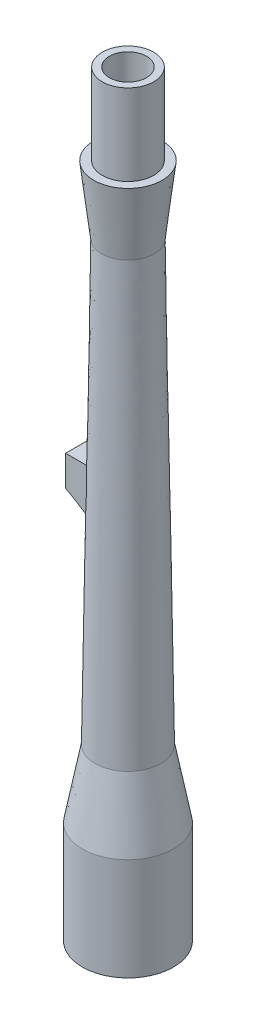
ISO-10303-21;
HEADER;
FILE_DESCRIPTION(('STEP AP214'),'2;1');
FILE_NAME('part.step','',(''),(''),'','','');
FILE_SCHEMA(('AUTOMOTIVE_DESIGN { 1 0 10303 214 1 1 1 1 }'));
ENDSEC;
DATA;
#1=APPLICATION_CONTEXT('core data for automotive mechanical design processes');
#2=APPLICATION_PROTOCOL_DEFINITION('international standard','automotive_design',2000,#1);
#3=PRODUCT_CONTEXT('',#1,'mechanical');
#4=PRODUCT('Part','Part','',(#3));
#5=PRODUCT_RELATED_PRODUCT_CATEGORY('part','',(#4));
#6=PRODUCT_DEFINITION_FORMATION('','',#4);
#7=PRODUCT_DEFINITION_CONTEXT('part definition',#1,'design');
#8=PRODUCT_DEFINITION('design','',#6,#7);
#9=PRODUCT_DEFINITION_SHAPE('','',#8);
#10=(LENGTH_UNIT() NAMED_UNIT(*) SI_UNIT(.MILLI.,.METRE.));
#11=(NAMED_UNIT(*) PLANE_ANGLE_UNIT() SI_UNIT($,.RADIAN.));
#12=(NAMED_UNIT(*) SI_UNIT($,.STERADIAN.) SOLID_ANGLE_UNIT());
#13=UNCERTAINTY_MEASURE_WITH_UNIT(LENGTH_MEASURE(1.E-05),#10,'distance_accuracy_value','');
#14=(GEOMETRIC_REPRESENTATION_CONTEXT(3) GLOBAL_UNCERTAINTY_ASSIGNED_CONTEXT((#13)) GLOBAL_UNIT_ASSIGNED_CONTEXT((#10,
#11,#12)) REPRESENTATION_CONTEXT('',''));
#15=CARTESIAN_POINT('',(0.,0.,0.));
#16=DIRECTION('',(0.,0.,1.));
#17=DIRECTION('',(1.,0.,0.));
#18=AXIS2_PLACEMENT_3D('',#15,#16,#17);
#19=CARTESIAN_POINT('',(0.,230.3,0.));
#20=DIRECTION('',(0.,1.,0.));
#21=DIRECTION('',(-1.,0.,0.));
#22=AXIS2_PLACEMENT_3D('',#19,#20,#21);
#23=CYLINDRICAL_SURFACE('',#22,11.);
#24=CARTESIAN_POINT('',(0.,200.,0.));
#25=DIRECTION('',(0.,1.,0.));
#26=DIRECTION('',(-1.,0.,0.));
#27=AXIS2_PLACEMENT_3D('',#24,#25,#26);
#28=CIRCLE('',#27,11.);
#29=CARTESIAN_POINT('',(-11.,200.,0.));
#30=VERTEX_POINT('',#29);
#31=EDGE_CURVE('E258',#30,#30,#28,.T.);
#32=ORIENTED_EDGE('',*,*,#31,.F.);
#33=EDGE_LOOP('',(#32));
#34=FACE_BOUND('',#33,.T.);
#35=CARTESIAN_POINT('',(0.,224.45467,0.));
#36=DIRECTION('',(0.,-1.,0.));
#37=DIRECTION('',(0.,0.,-1.));
#38=AXIS2_PLACEMENT_3D('',#35,#36,#37);
#39=CIRCLE('',#38,11.);
#40=CARTESIAN_POINT('',(0.,224.45467,-11.));
#41=VERTEX_POINT('',#40);
#42=EDGE_CURVE('E240',#41,#41,#39,.T.);
#43=ORIENTED_EDGE('',*,*,#42,.F.);
#44=EDGE_LOOP('',(#43));
#45=FACE_BOUND('',#44,.T.);
#46=ADVANCED_FACE('F41',(#34,#45),#23,.F.);
#47=CARTESIAN_POINT('',(-7.46,430.,0.));
#48=CARTESIAN_POINT('',(-7.52130513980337,403.332104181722,0.));
#49=CARTESIAN_POINT('',(-7.94290668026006,359.996277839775,0.));
#50=CARTESIAN_POINT('',(-9.07448264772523,300.00138721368,0.));
#51=CARTESIAN_POINT('',(-9.85605058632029,233.319068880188,0.));
#52=CARTESIAN_POINT('',(-11.2476776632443,183.3164327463,0.));
#53=CARTESIAN_POINT('',(-12.75,150.,0.));
#54=B_SPLINE_CURVE_WITH_KNOTS('',3,(#47,#48,#49,#50,#51,#52,#53),.UNSPECIFIED.,.F.,.F.,(4,1,1,1,
4),(0.,0.285662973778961,0.464218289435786,0.642768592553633,1.),.UNSPECIFIED.);
#55=CARTESIAN_POINT('',(0.,200.,0.));
#56=DIRECTION('',(0.,-1.,0.));
#57=AXIS1_PLACEMENT('',#55,#56);
#58=SURFACE_OF_REVOLUTION('',#54,#57);
#59=CARTESIAN_POINT('',(0.,380.000039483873,0.));
#60=DIRECTION('',(0.,-1.,0.));
#61=DIRECTION('',(0.,0.,-1.));
#62=AXIS2_PLACEMENT_3D('',#59,#60,#61);
#63=CIRCLE('',#62,7.79532596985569);
#64=CARTESIAN_POINT('',(0.,380.000039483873,-7.79532596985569));
#65=VERTEX_POINT('',#64);
#66=EDGE_CURVE('E207',#65,#65,#63,.F.);
#67=ORIENTED_EDGE('',*,*,#66,.F.);
#68=EDGE_LOOP('',(#67));
#69=FACE_BOUND('',#68,.T.);
#70=CARTESIAN_POINT('',(0.,250.299649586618,0.));
#71=DIRECTION('',(0.,-1.,0.));
#72=DIRECTION('',(0.,0.,-1.));
#73=AXIS2_PLACEMENT_3D('',#70,#71,#72);
#74=CIRCLE('',#73,9.74488898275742);
#75=CARTESIAN_POINT('',(0.,250.299649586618,-9.74488898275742));
#76=VERTEX_POINT('',#75);
#77=EDGE_CURVE('E201',#76,#76,#74,.T.);
#78=ORIENTED_EDGE('',*,*,#77,.F.);
#79=EDGE_LOOP('',(#78));
#80=FACE_BOUND('',#79,.T.);
#81=CARTESIAN_POINT('',(-8.61763517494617,320.746955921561,-1.));
#82=CARTESIAN_POINT('',(-8.63626826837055,319.660380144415,-1.));
#83=CARTESIAN_POINT('',(-8.6548555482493,318.57380357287,-1.));
#84=CARTESIAN_POINT('',(-8.69187271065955,316.400647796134,-1.));
#85=CARTESIAN_POINT('',(-8.71030259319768,315.314068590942,-1.));
#86=CARTESIAN_POINT('',(-8.74693919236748,313.140906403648,-1.));
#87=CARTESIAN_POINT('',(-8.76514590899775,312.054323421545,-1.));
#88=CARTESIAN_POINT('',(-8.80127043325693,309.881152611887,-1.));
#89=CARTESIAN_POINT('',(-8.81918824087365,308.794564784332,-1.));
#90=CARTESIAN_POINT('',(-8.83692872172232,307.707974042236,-1.));
#91=B_SPLINE_CURVE_WITH_KNOTS('',3,(#81,#82,#83,#84,#85,#86,#87,#88,#89,#90),.UNSPECIFIED.,.F.,
.F.,(4,2,2,2,4),(0.,3.26020660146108,6.52041306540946,9.78061954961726,13.0408261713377),.UNSPECIFIED.);
#92=CARTESIAN_POINT('',(-8.61763517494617,320.746955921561,-1.));
#93=VERTEX_POINT('',#92);
#94=CARTESIAN_POINT('',(-8.81601590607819,308.983994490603,-1.));
#95=VERTEX_POINT('',#94);
#96=EDGE_CURVE('E11',#93,#95,#91,.T.);
#97=ORIENTED_EDGE('',*,*,#96,.F.);
#98=CARTESIAN_POINT('',(0.,320.746955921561,0.));
#99=DIRECTION('',(0.,-1.,0.));
#100=DIRECTION('',(0.,0.,-1.));
#101=AXIS2_PLACEMENT_3D('',#98,#99,#100);
#102=CIRCLE('',#101,8.67546171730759);
#103=CARTESIAN_POINT('',(-7.08968518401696,320.746955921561,5.));
#104=VERTEX_POINT('',#103);
#105=EDGE_CURVE('E128',#93,#104,#102,.F.);
#106=ORIENTED_EDGE('',*,*,#105,.T.);
#107=CARTESIAN_POINT('',(-7.08968518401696,320.746955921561,5.));
#108=CARTESIAN_POINT('',(-7.11233404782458,319.660385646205,5.));
#109=CARTESIAN_POINT('',(-7.13489191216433,318.573813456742,5.));
#110=CARTESIAN_POINT('',(-7.17974975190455,316.400663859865,5.));
#111=CARTESIAN_POINT('',(-7.20204972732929,315.314086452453,5.));
#112=CARTESIAN_POINT('',(-7.24631590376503,313.140924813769,5.));
#113=CARTESIAN_POINT('',(-7.26828210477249,312.054340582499,5.));
#114=CARTESIAN_POINT('',(-7.31180591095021,309.881163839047,5.));
#115=CARTESIAN_POINT('',(-7.333363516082,308.794571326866,5.));
#116=CARTESIAN_POINT('',(-7.35467941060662,307.707974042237,5.));
#117=B_SPLINE_CURVE_WITH_KNOTS('',3,(#107,#108,#109,#110,#111,#112,#113,#114,#115,#116),
.UNSPECIFIED.,.F.,.F.,(4,2,2,2,4),(0.,3.26041892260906,6.52083753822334,9.78125618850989,
13.0416751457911),.UNSPECIFIED.);
#118=CARTESIAN_POINT('',(-7.34781099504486,308.057673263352,5.));
#119=VERTEX_POINT('',#118);
#120=EDGE_CURVE('E52',#104,#119,#117,.T.);
#121=ORIENTED_EDGE('',*,*,#120,.T.);
#122=CARTESIAN_POINT('',(-7.34781099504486,308.057673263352,5.));
#123=CARTESIAN_POINT('',(-7.42809929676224,308.108328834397,4.88055422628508));
#124=CARTESIAN_POINT('',(-7.5058272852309,308.157369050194,4.75868972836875));
#125=CARTESIAN_POINT('',(-7.65588052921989,308.252040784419,4.51028605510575));
#126=CARTESIAN_POINT('',(-7.7282024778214,308.297670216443,4.38374408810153));
#127=CARTESIAN_POINT('',(-7.86707555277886,308.385288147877,4.12627106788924));
#128=CARTESIAN_POINT('',(-7.93362565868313,308.427276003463,3.99533924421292));
#129=CARTESIAN_POINT('',(-8.06085426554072,308.507547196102,3.72890131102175));
#130=CARTESIAN_POINT('',(-8.12151002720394,308.545816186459,3.59338001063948));
#131=CARTESIAN_POINT('',(-8.23634341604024,308.618266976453,3.31857741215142));
#132=CARTESIAN_POINT('',(-8.29052222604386,308.652449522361,3.17929680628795));
#133=CARTESIAN_POINT('',(-8.39210993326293,308.716543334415,2.89734726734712));
#134=CARTESIAN_POINT('',(-8.43951939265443,308.74645495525,2.75467861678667));
#135=CARTESIAN_POINT('',(-8.54949916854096,308.815843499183,2.39341072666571));
#136=CARTESIAN_POINT('',(-8.6076170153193,308.852511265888,2.17288834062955));
#137=CARTESIAN_POINT('',(-8.70707624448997,308.915262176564,1.72660703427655));
#138=CARTESIAN_POINT('',(-8.74841638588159,308.941344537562,1.50084772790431));
#139=CARTESIAN_POINT('',(-8.8136145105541,308.982479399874,1.04655011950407));
#140=CARTESIAN_POINT('',(-8.8375270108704,308.997566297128,0.81802277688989));
#141=CARTESIAN_POINT('',(-8.8677070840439,309.01660753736,0.359448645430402));
#142=CARTESIAN_POINT('',(-8.87398462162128,309.020568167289,0.129402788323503));
#143=CARTESIAN_POINT('',(-8.86972398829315,309.017880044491,-0.250915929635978));
#144=CARTESIAN_POINT('',(-8.8642456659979,309.014423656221,-0.40129371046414));
#145=CARTESIAN_POINT('',(-8.84575957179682,309.002760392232,-0.701303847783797));
#146=CARTESIAN_POINT('',(-8.8327566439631,308.994556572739,-0.85093662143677));
#147=CARTESIAN_POINT('',(-8.8160159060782,308.983994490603,-0.999999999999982));
#148=B_SPLINE_CURVE_WITH_KNOTS('',3,(#122,#123,#124,#125,#126,#127,#128,#129,#130,#131,#132,
#133,#134,#135,#136,#137,#138,#139,#140,#141,#142,#143,#144,#145,#146,#147),.UNSPECIFIED.,.F.,
.F.,(4,2,2,2,2,2,2,2,2,2,2,2,4),(0.,0.457694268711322,0.915666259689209,1.37371905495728,
1.83347407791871,2.29314501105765,2.75277774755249,3.4447791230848,4.13683167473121,
4.82670994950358,5.516198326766,5.96750313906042,6.41851774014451),.UNSPECIFIED.);
#149=EDGE_CURVE('E131',#119,#95,#148,.T.);
#150=ORIENTED_EDGE('',*,*,#149,.T.);
#151=EDGE_LOOP('',(#97,#106,#121,#150));
#152=FACE_BOUND('',#151,.T.);
#153=ADVANCED_FACE('F43',(#69,#80,#152),#58,.T.);
#154=CARTESIAN_POINT('',(-5.485,429.997729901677,0.));
#155=CARTESIAN_POINT('',(-5.53827329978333,406.823705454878,0.));
#156=CARTESIAN_POINT('',(-5.74108343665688,383.650928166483,0.));
#157=CARTESIAN_POINT('',(-6.22215568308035,348.893237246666,0.));
#158=CARTESIAN_POINT('',(-6.41723422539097,337.307881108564,0.));
#159=CARTESIAN_POINT('',(-6.71421534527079,319.92992685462,0.));
#160=CARTESIAN_POINT('',(-6.81336715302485,314.137277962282,0.));
#161=CARTESIAN_POINT('',(-7.00207360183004,302.551826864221,0.));
#162=CARTESIAN_POINT('',(-7.09017714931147,296.759001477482,0.));
#163=CARTESIAN_POINT('',(-7.33859996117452,279.380271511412,0.));
#164=CARTESIAN_POINT('',(-7.4884376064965,267.794068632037,0.));
#165=CARTESIAN_POINT('',(-7.85657272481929,244.623381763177,0.));
#166=CARTESIAN_POINT('',(-8.07980515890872,233.039031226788,0.));
#167=CARTESIAN_POINT('',(-8.9046440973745,198.289912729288,0.));
#168=CARTESIAN_POINT('',(-9.65703972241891,175.128967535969,0.));
#169=CARTESIAN_POINT('',(-10.6846691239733,151.975,0.));
#170=B_SPLINE_CURVE_WITH_KNOTS('',3,(#154,#155,#156,#157,#158,#159,#160,#161,#162,#163,#164,
#165,#166,#167,#168,#169),.UNSPECIFIED.,.F.,.F.,(4,2,2,2,2,2,2,4),(0.,0.25,0.375,0.4375,
0.499999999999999,0.624999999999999,0.749999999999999,1.),.UNSPECIFIED.);
#171=CARTESIAN_POINT('',(0.,200.,0.));
#172=DIRECTION('',(0.,-1.,0.));
#173=AXIS1_PLACEMENT('',#171,#172);
#174=SURFACE_OF_REVOLUTION('',#170,#173);
#175=CARTESIAN_POINT('',(0.,424.,0.));
#176=DIRECTION('',(0.,-1.,0.));
#177=DIRECTION('',(0.,0.,-1.));
#178=AXIS2_PLACEMENT_3D('',#175,#176,#177);
#179=CIRCLE('',#178,5.50210644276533);
#180=CARTESIAN_POINT('',(0.,424.,-5.50210644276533));
#181=VERTEX_POINT('',#180);
#182=EDGE_CURVE('E234',#181,#181,#179,.T.);
#183=ORIENTED_EDGE('',*,*,#182,.F.);
#184=EDGE_LOOP('',(#183));
#185=FACE_BOUND('',#184,.T.);
#186=CARTESIAN_POINT('',(0.,230.300000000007,0.));
#187=DIRECTION('',(0.,-1.,0.));
#188=DIRECTION('',(0.,0.,-1.));
#189=AXIS2_PLACEMENT_3D('',#186,#187,#188);
#190=CIRCLE('',#189,8.15466933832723);
#191=CARTESIAN_POINT('',(0.,230.300000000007,-8.15466933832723));
#192=VERTEX_POINT('',#191);
#193=EDGE_CURVE('E237',#192,#192,#190,.T.);
#194=ORIENTED_EDGE('',*,*,#193,.T.);
#195=EDGE_LOOP('',(#194));
#196=FACE_BOUND('',#195,.T.);
#197=ADVANCED_FACE('F183',(#185,#196),#174,.F.);
#198=CARTESIAN_POINT('',(11.,200.,0.));
#199=DIRECTION('',(0.,1.,0.));
#200=DIRECTION('',(-1.,0.,0.));
#201=AXIS2_PLACEMENT_3D('',#198,#199,#200);
#202=PLANE('',#201);
#203=CARTESIAN_POINT('',(0.,200.,0.));
#204=DIRECTION('',(0.,1.,0.));
#205=DIRECTION('',(-1.,0.,0.));
#206=AXIS2_PLACEMENT_3D('',#203,#204,#205);
#207=CIRCLE('',#206,13.5);
#208=CARTESIAN_POINT('',(-13.5,200.,0.));
#209=VERTEX_POINT('',#208);
#210=EDGE_CURVE('E192',#209,#209,#207,.T.);
#211=ORIENTED_EDGE('',*,*,#210,.F.);
#212=EDGE_LOOP('',(#211));
#213=FACE_BOUND('',#212,.T.);
#214=ORIENTED_EDGE('',*,*,#31,.T.);
#215=EDGE_LOOP('',(#214));
#216=FACE_BOUND('',#215,.T.);
#217=ADVANCED_FACE('F180',(#213,#216),#202,.F.);
#218=CARTESIAN_POINT('',(0.,230.3,0.));
#219=DIRECTION('',(0.,1.,0.));
#220=DIRECTION('',(-1.,0.,0.));
#221=AXIS2_PLACEMENT_3D('',#218,#219,#220);
#222=CYLINDRICAL_SURFACE('',#221,13.5);
#223=CARTESIAN_POINT('',(0.,230.3,0.));
#224=DIRECTION('',(0.,1.,0.));
#225=DIRECTION('',(-1.,0.,0.));
#226=AXIS2_PLACEMENT_3D('',#223,#224,#225);
#227=CIRCLE('',#226,13.5);
#228=CARTESIAN_POINT('',(-13.5,230.3,0.));
#229=VERTEX_POINT('',#228);
#230=EDGE_CURVE('E261',#229,#229,#227,.T.);
#231=ORIENTED_EDGE('',*,*,#230,.F.);
#232=EDGE_LOOP('',(#231));
#233=FACE_BOUND('',#232,.T.);
#234=ORIENTED_EDGE('',*,*,#210,.T.);
#235=EDGE_LOOP('',(#234));
#236=FACE_BOUND('',#235,.T.);
#237=ADVANCED_FACE('F176',(#233,#236),#222,.T.);
#238=CARTESIAN_POINT('',(0.,230.3,0.));
#239=DIRECTION('',(0.,-1.,0.));
#240=DIRECTION('',(1.,0.,0.));
#241=AXIS2_PLACEMENT_3D('',#238,#239,#240);
#242=CONICAL_SURFACE('',#241,13.5,0.185597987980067);
#243=ORIENTED_EDGE('',*,*,#77,.T.);
#244=EDGE_LOOP('',(#243));
#245=FACE_BOUND('',#244,.T.);
#246=ORIENTED_EDGE('',*,*,#230,.T.);
#247=EDGE_LOOP('',(#246));
#248=FACE_BOUND('',#247,.T.);
#249=ADVANCED_FACE('F169',(#245,#248),#242,.T.);
#250=CARTESIAN_POINT('',(0.,380.000039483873,0.));
#251=DIRECTION('',(0.,1.,0.));
#252=DIRECTION('',(0.,0.,1.));
#253=AXIS2_PLACEMENT_3D('',#250,#251,#252);
#254=CONICAL_SURFACE('',#253,7.79532596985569,0.115221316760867);
#255=CARTESIAN_POINT('',(0.,400.,0.));
#256=DIRECTION('',(0.,1.,0.));
#257=DIRECTION('',(0.,0.,1.));
#258=AXIS2_PLACEMENT_3D('',#255,#256,#257);
#259=CIRCLE('',#258,10.11);
#260=CARTESIAN_POINT('',(0.,400.,10.11));
#261=VERTEX_POINT('',#260);
#262=EDGE_CURVE('E256',#261,#261,#259,.T.);
#263=ORIENTED_EDGE('',*,*,#262,.F.);
#264=EDGE_LOOP('',(#263));
#265=FACE_BOUND('',#264,.T.);
#266=ORIENTED_EDGE('',*,*,#66,.T.);
#267=EDGE_LOOP('',(#266));
#268=FACE_BOUND('',#267,.T.);
#269=ADVANCED_FACE('F165',(#265,#268),#254,.T.);
#270=CARTESIAN_POINT('',(0.,400.,0.));
#271=DIRECTION('',(0.,1.,0.));
#272=DIRECTION('',(0.,0.,1.));
#273=AXIS2_PLACEMENT_3D('',#270,#271,#272);
#274=PLANE('',#273);
#275=ORIENTED_EDGE('',*,*,#262,.T.);
#276=EDGE_LOOP('',(#275));
#277=FACE_BOUND('',#276,.T.);
#278=CARTESIAN_POINT('',(0.,400.,0.));
#279=DIRECTION('',(0.,1.,0.));
#280=DIRECTION('',(0.,0.,1.));
#281=AXIS2_PLACEMENT_3D('',#278,#279,#280);
#282=CIRCLE('',#281,7.61);
#283=CARTESIAN_POINT('',(0.,400.,7.61));
#284=VERTEX_POINT('',#283);
#285=EDGE_CURVE('E138',#284,#284,#282,.T.);
#286=ORIENTED_EDGE('',*,*,#285,.F.);
#287=EDGE_LOOP('',(#286));
#288=FACE_BOUND('',#287,.T.);
#289=ADVANCED_FACE('F161',(#277,#288),#274,.T.);
#290=CARTESIAN_POINT('',(0.,423.810637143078,0.));
#291=DIRECTION('',(0.,1.,0.));
#292=DIRECTION('',(0.,0.,1.));
#293=AXIS2_PLACEMENT_3D('',#290,#291,#292);
#294=CYLINDRICAL_SURFACE('',#293,7.61);
#295=CARTESIAN_POINT('',(0.,424.,0.));
#296=DIRECTION('',(0.,-1.,0.));
#297=DIRECTION('',(0.,0.,-1.));
#298=AXIS2_PLACEMENT_3D('',#295,#296,#297);
#299=CIRCLE('',#298,7.61);
#300=CARTESIAN_POINT('',(0.,424.,-7.61));
#301=VERTEX_POINT('',#300);
#302=EDGE_CURVE('E47',#301,#301,#299,.T.);
#303=ORIENTED_EDGE('',*,*,#302,.T.);
#304=EDGE_LOOP('',(#303));
#305=FACE_BOUND('',#304,.T.);
#306=ORIENTED_EDGE('',*,*,#285,.T.);
#307=EDGE_LOOP('',(#306));
#308=FACE_BOUND('',#307,.T.);
#309=ADVANCED_FACE('F158',(#305,#308),#294,.T.);
#310=CARTESIAN_POINT('',(-6.53984588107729,330.145325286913,-1.));
#311=DIRECTION('',(0.,0.,1.));
#312=DIRECTION('',(1.,0.,0.));
#313=AXIS2_PLACEMENT_3D('',#310,#311,#312);
#314=PLANE('',#313);
#315=DIRECTION('',(-1.,0.,0.));
#316=VECTOR('',#315,1.);
#317=CARTESIAN_POINT('',(-13.4605669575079,320.746955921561,-1.));
#318=LINE('',#317,#316);
#319=CARTESIAN_POINT('',(-13.4605669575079,320.746955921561,-1.));
#320=VERTEX_POINT('',#319);
#321=EDGE_CURVE('E105',#93,#320,#318,.T.);
#322=ORIENTED_EDGE('',*,*,#321,.F.);
#323=ORIENTED_EDGE('',*,*,#96,.T.);
#324=DIRECTION('',(0.845740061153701,-0.533595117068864,0.));
#325=VECTOR('',#324,1.);
#326=CARTESIAN_POINT('',(-10.4497,310.01472,-1.));
#327=LINE('',#326,#325);
#328=CARTESIAN_POINT('',(-10.4497,310.01472,-1.));
#329=VERTEX_POINT('',#328);
#330=EDGE_CURVE('E110',#329,#95,#327,.T.);
#331=ORIENTED_EDGE('',*,*,#330,.F.);
#332=DIRECTION('',(0.866783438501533,-0.498684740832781,0.));
#333=VECTOR('',#332,1.);
#334=CARTESIAN_POINT('',(-13.4605669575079,311.746955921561,-1.));
#335=LINE('',#334,#333);
#336=CARTESIAN_POINT('',(-13.4605669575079,311.746955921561,-1.));
#337=VERTEX_POINT('',#336);
#338=EDGE_CURVE('E122',#337,#329,#335,.T.);
#339=ORIENTED_EDGE('',*,*,#338,.F.);
#340=DIRECTION('',(0.,-1.,0.));
#341=VECTOR('',#340,1.);
#342=CARTESIAN_POINT('',(-13.4605669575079,311.746955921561,-1.));
#343=LINE('',#342,#341);
#344=EDGE_CURVE('E120',#320,#337,#343,.T.);
#345=ORIENTED_EDGE('',*,*,#344,.F.);
#346=EDGE_LOOP('',(#322,#323,#331,#339,#345));
#347=FACE_BOUND('',#346,.T.);
#348=ADVANCED_FACE('F146',(#347),#314,.F.);
#349=CARTESIAN_POINT('',(-6.53984588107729,330.145325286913,5.));
#350=DIRECTION('',(0.,0.,1.));
#351=DIRECTION('',(1.,0.,0.));
#352=AXIS2_PLACEMENT_3D('',#349,#350,#351);
#353=PLANE('',#352);
#354=ORIENTED_EDGE('',*,*,#120,.F.);
#355=DIRECTION('',(-1.,0.,0.));
#356=VECTOR('',#355,1.);
#357=CARTESIAN_POINT('',(-13.4605669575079,320.746955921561,5.));
#358=LINE('',#357,#356);
#359=CARTESIAN_POINT('',(-13.4605669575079,320.746955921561,5.));
#360=VERTEX_POINT('',#359);
#361=EDGE_CURVE('E91',#104,#360,#358,.T.);
#362=ORIENTED_EDGE('',*,*,#361,.T.);
#363=DIRECTION('',(0.,-1.,0.));
#364=VECTOR('',#363,1.);
#365=CARTESIAN_POINT('',(-13.4605669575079,311.746955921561,5.));
#366=LINE('',#365,#364);
#367=CARTESIAN_POINT('',(-13.4605669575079,311.746955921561,5.));
#368=VERTEX_POINT('',#367);
#369=EDGE_CURVE('E95',#360,#368,#366,.T.);
#370=ORIENTED_EDGE('',*,*,#369,.T.);
#371=DIRECTION('',(0.866783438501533,-0.498684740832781,0.));
#372=VECTOR('',#371,1.);
#373=CARTESIAN_POINT('',(-13.4605669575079,311.746955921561,5.));
#374=LINE('',#373,#372);
#375=CARTESIAN_POINT('',(-10.4497,310.01472,5.));
#376=VERTEX_POINT('',#375);
#377=EDGE_CURVE('E113',#368,#376,#374,.T.);
#378=ORIENTED_EDGE('',*,*,#377,.T.);
#379=DIRECTION('',(0.845740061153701,-0.533595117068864,0.));
#380=VECTOR('',#379,1.);
#381=CARTESIAN_POINT('',(-10.4497,310.01472,5.));
#382=LINE('',#381,#380);
#383=EDGE_CURVE('E59',#376,#119,#382,.T.);
#384=ORIENTED_EDGE('',*,*,#383,.T.);
#385=EDGE_LOOP('',(#354,#362,#370,#378,#384));
#386=FACE_BOUND('',#385,.T.);
#387=ADVANCED_FACE('F93',(#386),#353,.T.);
#388=CARTESIAN_POINT('',(-10.4497,310.01472,-1.));
#389=DIRECTION('',(-0.533595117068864,-0.845740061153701,0.));
#390=DIRECTION('',(0.845740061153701,-0.533595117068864,0.));
#391=AXIS2_PLACEMENT_3D('',#388,#389,#390);
#392=PLANE('',#391);
#393=ORIENTED_EDGE('',*,*,#149,.F.);
#394=ORIENTED_EDGE('',*,*,#383,.F.);
#395=DIRECTION('',(0.,0.,1.));
#396=VECTOR('',#395,1.);
#397=CARTESIAN_POINT('',(-10.4497,310.01472,-1.));
#398=LINE('',#397,#396);
#399=EDGE_CURVE('E126',#329,#376,#398,.T.);
#400=ORIENTED_EDGE('',*,*,#399,.F.);
#401=ORIENTED_EDGE('',*,*,#330,.T.);
#402=EDGE_LOOP('',(#393,#394,#400,#401));
#403=FACE_BOUND('',#402,.T.);
#404=ADVANCED_FACE('F140',(#403),#392,.T.);
#405=CARTESIAN_POINT('',(-13.4605669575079,320.746955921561,-1.));
#406=DIRECTION('',(0.,1.,0.));
#407=DIRECTION('',(0.,0.,1.));
#408=AXIS2_PLACEMENT_3D('',#405,#406,#407);
#409=PLANE('',#408);
#410=ORIENTED_EDGE('',*,*,#105,.F.);
#411=ORIENTED_EDGE('',*,*,#321,.T.);
#412=DIRECTION('',(0.,0.,1.));
#413=VECTOR('',#412,1.);
#414=CARTESIAN_POINT('',(-13.4605669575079,320.746955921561,-1.));
#415=LINE('',#414,#413);
#416=EDGE_CURVE('E103',#320,#360,#415,.T.);
#417=ORIENTED_EDGE('',*,*,#416,.T.);
#418=ORIENTED_EDGE('',*,*,#361,.F.);
#419=EDGE_LOOP('',(#410,#411,#417,#418));
#420=FACE_BOUND('',#419,.T.);
#421=ADVANCED_FACE('F104',(#420),#409,.T.);
#422=CARTESIAN_POINT('',(-13.4605669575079,311.746955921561,-1.));
#423=DIRECTION('',(-0.498684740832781,-0.866783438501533,0.));
#424=DIRECTION('',(0.866783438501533,-0.498684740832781,0.));
#425=AXIS2_PLACEMENT_3D('',#422,#423,#424);
#426=PLANE('',#425);
#427=ORIENTED_EDGE('',*,*,#399,.T.);
#428=ORIENTED_EDGE('',*,*,#377,.F.);
#429=DIRECTION('',(0.,0.,1.));
#430=VECTOR('',#429,1.);
#431=CARTESIAN_POINT('',(-13.4605669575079,311.746955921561,-1.));
#432=LINE('',#431,#430);
#433=EDGE_CURVE('E109',#337,#368,#432,.T.);
#434=ORIENTED_EDGE('',*,*,#433,.F.);
#435=ORIENTED_EDGE('',*,*,#338,.T.);
#436=EDGE_LOOP('',(#427,#428,#434,#435));
#437=FACE_BOUND('',#436,.T.);
#438=ADVANCED_FACE('F149',(#437),#426,.T.);
#439=CARTESIAN_POINT('',(-13.4605669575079,311.746955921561,-1.));
#440=DIRECTION('',(-1.,0.,0.));
#441=DIRECTION('',(0.,0.,1.));
#442=AXIS2_PLACEMENT_3D('',#439,#440,#441);
#443=PLANE('',#442);
#444=ORIENTED_EDGE('',*,*,#433,.T.);
#445=ORIENTED_EDGE('',*,*,#369,.F.);
#446=ORIENTED_EDGE('',*,*,#416,.F.);
#447=ORIENTED_EDGE('',*,*,#344,.T.);
#448=EDGE_LOOP('',(#444,#445,#446,#447));
#449=FACE_BOUND('',#448,.T.);
#450=ADVANCED_FACE('F112',(#449),#443,.T.);
#451=CARTESIAN_POINT('',(0.,230.3,0.));
#452=DIRECTION('',(0.,-1.,0.));
#453=DIRECTION('',(0.,0.,-1.));
#454=AXIS2_PLACEMENT_3D('',#451,#452,#453);
#455=CYLINDRICAL_SURFACE('',#454,8.15466933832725);
#456=ORIENTED_EDGE('',*,*,#193,.F.);
#457=EDGE_LOOP('',(#456));
#458=FACE_BOUND('',#457,.T.);
#459=CARTESIAN_POINT('',(0.,227.300000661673,0.));
#460=DIRECTION('',(0.,-1.,0.));
#461=DIRECTION('',(0.,0.,-1.));
#462=AXIS2_PLACEMENT_3D('',#459,#460,#461);
#463=CIRCLE('',#462,8.15466933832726);
#464=CARTESIAN_POINT('',(0.,227.300000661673,-8.15466933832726));
#465=VERTEX_POINT('',#464);
#466=EDGE_CURVE('E100',#465,#465,#463,.T.);
#467=ORIENTED_EDGE('',*,*,#466,.T.);
#468=EDGE_LOOP('',(#467));
#469=FACE_BOUND('',#468,.T.);
#470=ADVANCED_FACE('F155',(#458,#469),#455,.F.);
#471=CARTESIAN_POINT('',(0.,224.45467,0.));
#472=DIRECTION('',(0.,-1.,0.));
#473=DIRECTION('',(0.,0.,-1.));
#474=AXIS2_PLACEMENT_3D('',#471,#472,#473);
#475=CONICAL_SURFACE('',#474,11.,0.785398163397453);
#476=ORIENTED_EDGE('',*,*,#466,.F.);
#477=EDGE_LOOP('',(#476));
#478=FACE_BOUND('',#477,.T.);
#479=ORIENTED_EDGE('',*,*,#42,.T.);
#480=EDGE_LOOP('',(#479));
#481=FACE_BOUND('',#480,.T.);
#482=ADVANCED_FACE('F221',(#478,#481),#475,.F.);
#483=CARTESIAN_POINT('',(13.2483258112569,424.,-13.5));
#484=DIRECTION('',(0.,-1.,0.));
#485=DIRECTION('',(0.,0.,-1.));
#486=AXIS2_PLACEMENT_3D('',#483,#484,#485);
#487=PLANE('',#486);
#488=ORIENTED_EDGE('',*,*,#182,.T.);
#489=EDGE_LOOP('',(#488));
#490=FACE_BOUND('',#489,.T.);
#491=ORIENTED_EDGE('',*,*,#302,.F.);
#492=EDGE_LOOP('',(#491));
#493=FACE_BOUND('',#492,.T.);
#494=ADVANCED_FACE('F225',(#490,#493),#487,.F.);
#495=CLOSED_SHELL('',(#46,#153,#197,#217,#237,#249,#269,#289,#309,#348,#387,#404,#421,#438,#450,
#470,#482,#494));
#496=MANIFOLD_SOLID_BREP('B2',#495);
#497=ADVANCED_BREP_SHAPE_REPRESENTATION('',(#18,#496),#14);
#498=SHAPE_DEFINITION_REPRESENTATION(#9,#497);
ENDSEC;
END-ISO-10303-21;
